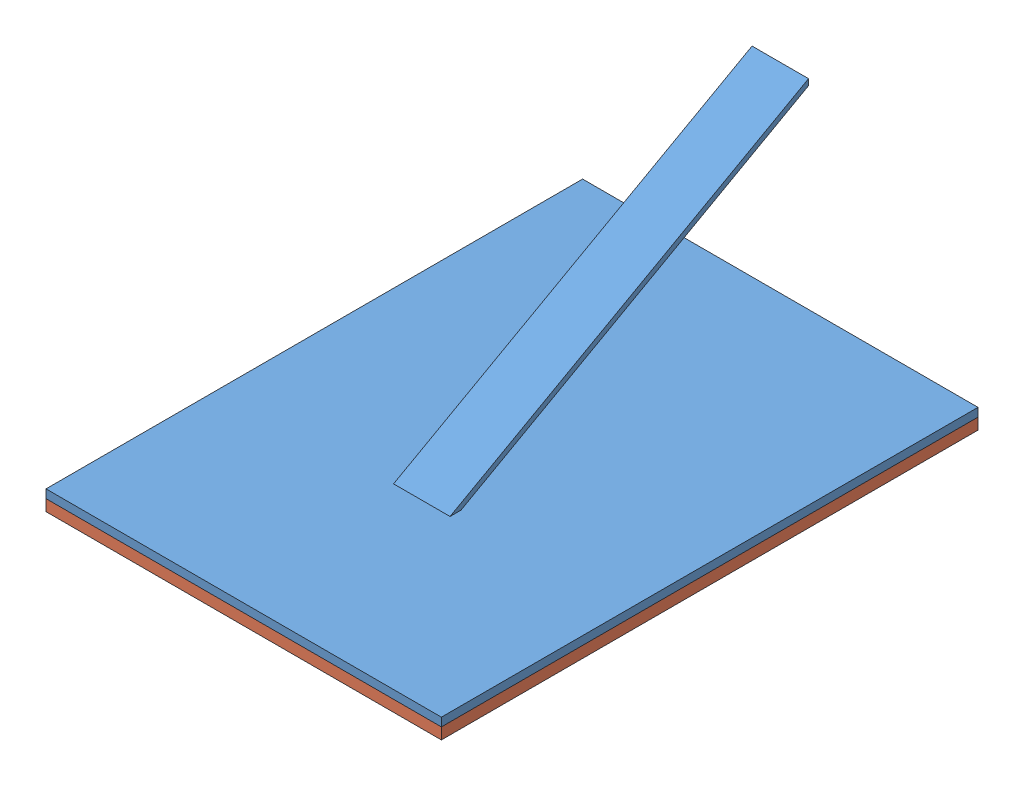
SolidWorks assembly Assem1.sldasm, configuration По умолчанию (file format 5000). Lengths in mm.
Overall size (140 79.78 190).
2 component instances, 2 part files, 3 mates.
Components (placement in the parent):
- noga-1: noga.SLDPRT [По умолчанию] at origin size (140 73.78 190)
- rama-1: rama.SLDPRT [По умолчанию] at (0 -3 -170) x (1 0 0) z (0 0 -1) size (140 6 190)
Mates (geometry in assembly coordinates):
- Coincident1: coincident: plane of noga-1 through (0 -3 0) normal (0 -1 0); plane of rama-1 through (0 -3 -170) normal (0 1 0)
- Coincident2: coincident: line of noga-1 through (70 -3 0) axis (0 0 -1); line of rama-1 through (70 -3 0) axis (0 0 -1)
- Coincident3: coincident aligned: line of noga-1 through (-70 -3 0) axis (1 0 0); line of rama-1 through (-70 -3 0) axis (1 0 0)
